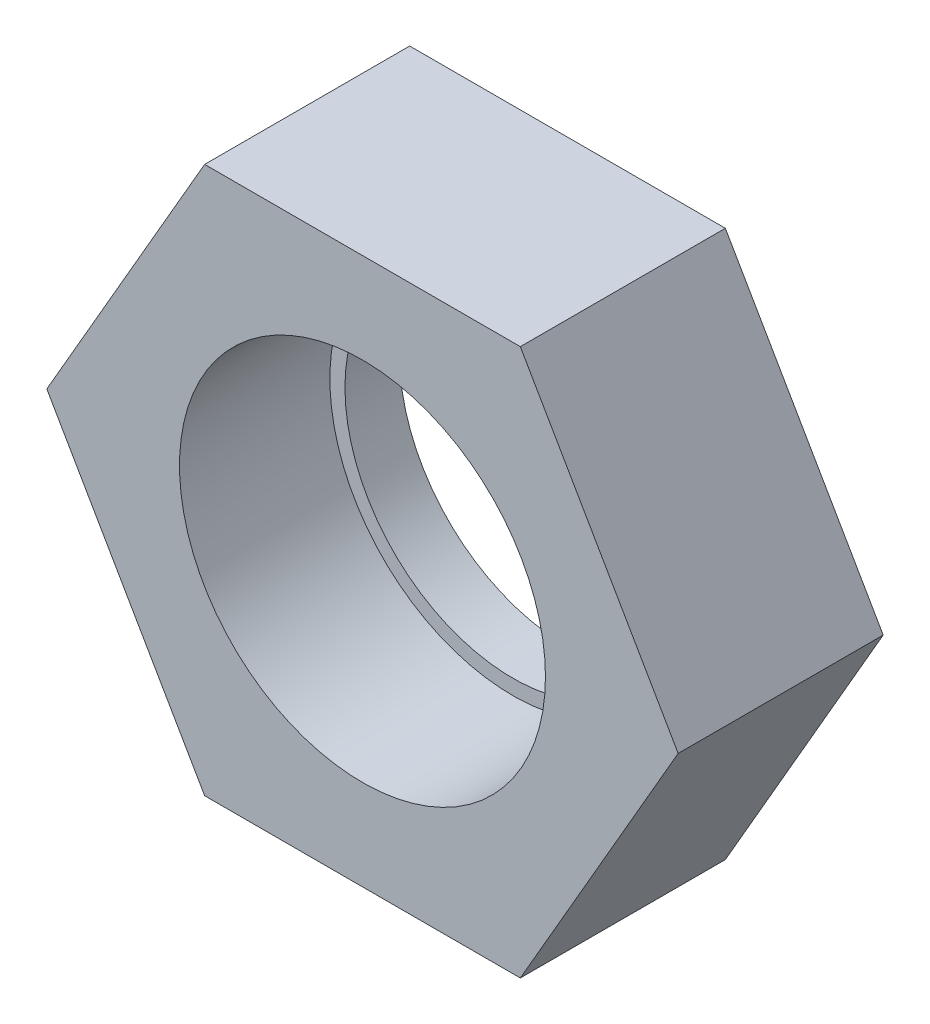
ISO-10303-21;
HEADER;
FILE_DESCRIPTION(('STEP AP214'),'2;1');
FILE_NAME('part.step','',(''),(''),'','','');
FILE_SCHEMA(('AUTOMOTIVE_DESIGN { 1 0 10303 214 1 1 1 1 }'));
ENDSEC;
DATA;
#1=APPLICATION_CONTEXT('core data for automotive mechanical design processes');
#2=APPLICATION_PROTOCOL_DEFINITION('international standard','automotive_design',2000,#1);
#3=PRODUCT_CONTEXT('',#1,'mechanical');
#4=PRODUCT('Part','Part','',(#3));
#5=PRODUCT_RELATED_PRODUCT_CATEGORY('part','',(#4));
#6=PRODUCT_DEFINITION_FORMATION('','',#4);
#7=PRODUCT_DEFINITION_CONTEXT('part definition',#1,'design');
#8=PRODUCT_DEFINITION('design','',#6,#7);
#9=PRODUCT_DEFINITION_SHAPE('','',#8);
#10=(LENGTH_UNIT() NAMED_UNIT(*) SI_UNIT(.MILLI.,.METRE.));
#11=(NAMED_UNIT(*) PLANE_ANGLE_UNIT() SI_UNIT($,.RADIAN.));
#12=(NAMED_UNIT(*) SI_UNIT($,.STERADIAN.) SOLID_ANGLE_UNIT());
#13=UNCERTAINTY_MEASURE_WITH_UNIT(LENGTH_MEASURE(1.E-05),#10,'distance_accuracy_value','');
#14=(GEOMETRIC_REPRESENTATION_CONTEXT(3) GLOBAL_UNCERTAINTY_ASSIGNED_CONTEXT((#13)) GLOBAL_UNIT_ASSIGNED_CONTEXT((#10,
#11,#12)) REPRESENTATION_CONTEXT('',''));
#15=CARTESIAN_POINT('',(0.,0.,0.));
#16=DIRECTION('',(0.,0.,1.));
#17=DIRECTION('',(1.,0.,0.));
#18=AXIS2_PLACEMENT_3D('',#15,#16,#17);
#19=CARTESIAN_POINT('',(8.9916,0.,2.54));
#20=DIRECTION('',(0.,0.,1.));
#21=DIRECTION('',(1.,0.,0.));
#22=AXIS2_PLACEMENT_3D('',#19,#20,#21);
#23=PLANE('',#22);
#24=CARTESIAN_POINT('',(0.,0.,2.54));
#25=DIRECTION('',(0.,0.,1.));
#26=DIRECTION('',(1.,0.,0.));
#27=AXIS2_PLACEMENT_3D('',#24,#25,#26);
#28=CIRCLE('',#27,8.5);
#29=CARTESIAN_POINT('',(8.5,0.,2.54));
#30=VERTEX_POINT('',#29);
#31=EDGE_CURVE('E86',#30,#30,#28,.F.);
#32=ORIENTED_EDGE('',*,*,#31,.F.);
#33=EDGE_LOOP('',(#32));
#34=FACE_BOUND('',#33,.T.);
#35=CARTESIAN_POINT('',(0.,0.,2.54));
#36=DIRECTION('',(0.,0.,1.));
#37=DIRECTION('',(1.,0.,0.));
#38=AXIS2_PLACEMENT_3D('',#35,#36,#37);
#39=CIRCLE('',#38,7.8);
#40=CARTESIAN_POINT('',(7.8,0.,2.54));
#41=VERTEX_POINT('',#40);
#42=EDGE_CURVE('E240',#41,#41,#39,.T.);
#43=ORIENTED_EDGE('',*,*,#42,.F.);
#44=EDGE_LOOP('',(#43));
#45=FACE_BOUND('',#44,.T.);
#46=ADVANCED_FACE('F14',(#34,#45),#23,.T.);
#47=CARTESIAN_POINT('',(21.9970452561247,12.7,9.525));
#48=DIRECTION('',(0.,0.,1.));
#49=DIRECTION('',(1.,0.,0.));
#50=AXIS2_PLACEMENT_3D('',#47,#48,#49);
#51=PLANE('',#50);
#52=DIRECTION('',(0.5,0.866025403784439,0.));
#53=VECTOR('',#52,1.);
#54=CARTESIAN_POINT('',(7.33234841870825,-12.7,9.525));
#55=LINE('',#54,#53);
#56=CARTESIAN_POINT('',(7.33234841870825,-12.7,9.525));
#57=VERTEX_POINT('',#56);
#58=CARTESIAN_POINT('',(14.6646968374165,0.,9.525));
#59=VERTEX_POINT('',#58);
#60=EDGE_CURVE('E100',#57,#59,#55,.T.);
#61=ORIENTED_EDGE('',*,*,#60,.T.);
#62=DIRECTION('',(-0.5,0.866025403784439,0.));
#63=VECTOR('',#62,1.);
#64=CARTESIAN_POINT('',(14.6646968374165,0.,9.525));
#65=LINE('',#64,#63);
#66=CARTESIAN_POINT('',(7.33234841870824,12.7,9.525));
#67=VERTEX_POINT('',#66);
#68=EDGE_CURVE('E81',#59,#67,#65,.T.);
#69=ORIENTED_EDGE('',*,*,#68,.T.);
#70=DIRECTION('',(-1.,0.,0.));
#71=VECTOR('',#70,1.);
#72=CARTESIAN_POINT('',(7.33234841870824,12.7,9.525));
#73=LINE('',#72,#71);
#74=CARTESIAN_POINT('',(-7.33234841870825,12.7,9.525));
#75=VERTEX_POINT('',#74);
#76=EDGE_CURVE('E103',#67,#75,#73,.T.);
#77=ORIENTED_EDGE('',*,*,#76,.T.);
#78=DIRECTION('',(-0.5,-0.866025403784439,0.));
#79=VECTOR('',#78,1.);
#80=CARTESIAN_POINT('',(-7.33234841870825,12.7,9.525));
#81=LINE('',#80,#79);
#82=CARTESIAN_POINT('',(-14.6646968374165,0.,9.525));
#83=VERTEX_POINT('',#82);
#84=EDGE_CURVE('E105',#75,#83,#81,.T.);
#85=ORIENTED_EDGE('',*,*,#84,.T.);
#86=DIRECTION('',(0.5,-0.866025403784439,0.));
#87=VECTOR('',#86,1.);
#88=CARTESIAN_POINT('',(-14.6646968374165,0.,9.525));
#89=LINE('',#88,#87);
#90=CARTESIAN_POINT('',(-7.33234841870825,-12.7,9.525));
#91=VERTEX_POINT('',#90);
#92=EDGE_CURVE('E34',#83,#91,#89,.T.);
#93=ORIENTED_EDGE('',*,*,#92,.T.);
#94=DIRECTION('',(1.,0.,0.));
#95=VECTOR('',#94,1.);
#96=CARTESIAN_POINT('',(-7.33234841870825,-12.7,9.525));
#97=LINE('',#96,#95);
#98=EDGE_CURVE('E29',#91,#57,#97,.T.);
#99=ORIENTED_EDGE('',*,*,#98,.T.);
#100=EDGE_LOOP('',(#61,#69,#77,#85,#93,#99));
#101=FACE_BOUND('',#100,.T.);
#102=CARTESIAN_POINT('',(0.,0.,9.525));
#103=DIRECTION('',(0.,0.,1.));
#104=DIRECTION('',(1.,0.,0.));
#105=AXIS2_PLACEMENT_3D('',#102,#103,#104);
#106=CIRCLE('',#105,8.5);
#107=CARTESIAN_POINT('',(8.5,0.,9.525));
#108=VERTEX_POINT('',#107);
#109=EDGE_CURVE('E89',#108,#108,#106,.T.);
#110=ORIENTED_EDGE('',*,*,#109,.F.);
#111=EDGE_LOOP('',(#110));
#112=FACE_BOUND('',#111,.T.);
#113=ADVANCED_FACE('F123',(#101,#112),#51,.T.);
#114=CARTESIAN_POINT('',(21.9970452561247,12.7,0.));
#115=DIRECTION('',(0.,0.,1.));
#116=DIRECTION('',(1.,0.,0.));
#117=AXIS2_PLACEMENT_3D('',#114,#115,#116);
#118=PLANE('',#117);
#119=DIRECTION('',(0.5,0.866025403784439,0.));
#120=VECTOR('',#119,1.);
#121=CARTESIAN_POINT('',(7.33234841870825,-12.7,0.));
#122=LINE('',#121,#120);
#123=CARTESIAN_POINT('',(7.33234841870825,-12.7,0.));
#124=VERTEX_POINT('',#123);
#125=CARTESIAN_POINT('',(14.6646968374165,0.,0.));
#126=VERTEX_POINT('',#125);
#127=EDGE_CURVE('E72',#124,#126,#122,.T.);
#128=ORIENTED_EDGE('',*,*,#127,.F.);
#129=DIRECTION('',(1.,0.,0.));
#130=VECTOR('',#129,1.);
#131=CARTESIAN_POINT('',(-7.33234841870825,-12.7,0.));
#132=LINE('',#131,#130);
#133=CARTESIAN_POINT('',(-7.33234841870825,-12.7,0.));
#134=VERTEX_POINT('',#133);
#135=EDGE_CURVE('E98',#134,#124,#132,.T.);
#136=ORIENTED_EDGE('',*,*,#135,.F.);
#137=DIRECTION('',(0.5,-0.866025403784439,0.));
#138=VECTOR('',#137,1.);
#139=CARTESIAN_POINT('',(-14.6646968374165,0.,0.));
#140=LINE('',#139,#138);
#141=CARTESIAN_POINT('',(-14.6646968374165,0.,0.));
#142=VERTEX_POINT('',#141);
#143=EDGE_CURVE('E96',#142,#134,#140,.T.);
#144=ORIENTED_EDGE('',*,*,#143,.F.);
#145=DIRECTION('',(-0.5,-0.866025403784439,0.));
#146=VECTOR('',#145,1.);
#147=CARTESIAN_POINT('',(-7.33234841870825,12.7,0.));
#148=LINE('',#147,#146);
#149=CARTESIAN_POINT('',(-7.33234841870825,12.7,0.));
#150=VERTEX_POINT('',#149);
#151=EDGE_CURVE('E94',#150,#142,#148,.T.);
#152=ORIENTED_EDGE('',*,*,#151,.F.);
#153=DIRECTION('',(-1.,0.,0.));
#154=VECTOR('',#153,1.);
#155=CARTESIAN_POINT('',(7.33234841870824,12.7,0.));
#156=LINE('',#155,#154);
#157=CARTESIAN_POINT('',(7.33234841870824,12.7,0.));
#158=VERTEX_POINT('',#157);
#159=EDGE_CURVE('E74',#158,#150,#156,.T.);
#160=ORIENTED_EDGE('',*,*,#159,.F.);
#161=DIRECTION('',(-0.5,0.866025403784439,0.));
#162=VECTOR('',#161,1.);
#163=CARTESIAN_POINT('',(14.6646968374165,0.,0.));
#164=LINE('',#163,#162);
#165=EDGE_CURVE('E67',#126,#158,#164,.T.);
#166=ORIENTED_EDGE('',*,*,#165,.F.);
#167=EDGE_LOOP('',(#128,#136,#144,#152,#160,#166));
#168=FACE_BOUND('',#167,.T.);
#169=CARTESIAN_POINT('',(0.,0.,0.));
#170=DIRECTION('',(0.,0.,1.));
#171=DIRECTION('',(1.,0.,0.));
#172=AXIS2_PLACEMENT_3D('',#169,#170,#171);
#173=CIRCLE('',#172,7.8);
#174=CARTESIAN_POINT('',(7.8,0.,0.));
#175=VERTEX_POINT('',#174);
#176=EDGE_CURVE('E237',#175,#175,#173,.F.);
#177=ORIENTED_EDGE('',*,*,#176,.F.);
#178=EDGE_LOOP('',(#177));
#179=FACE_BOUND('',#178,.T.);
#180=ADVANCED_FACE('F68',(#168,#179),#118,.F.);
#181=CARTESIAN_POINT('',(7.33234841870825,-12.7,9.525));
#182=DIRECTION('',(-0.866025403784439,0.5,0.));
#183=DIRECTION('',(-0.5,-0.866025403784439,0.));
#184=AXIS2_PLACEMENT_3D('',#181,#182,#183);
#185=PLANE('',#184);
#186=ORIENTED_EDGE('',*,*,#127,.T.);
#187=DIRECTION('',(0.,0.,-1.));
#188=VECTOR('',#187,1.);
#189=CARTESIAN_POINT('',(14.6646968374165,0.,9.525));
#190=LINE('',#189,#188);
#191=EDGE_CURVE('E9',#59,#126,#190,.T.);
#192=ORIENTED_EDGE('',*,*,#191,.F.);
#193=ORIENTED_EDGE('',*,*,#60,.F.);
#194=DIRECTION('',(0.,0.,-1.));
#195=VECTOR('',#194,1.);
#196=CARTESIAN_POINT('',(7.33234841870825,-12.7,9.525));
#197=LINE('',#196,#195);
#198=EDGE_CURVE('E85',#57,#124,#197,.T.);
#199=ORIENTED_EDGE('',*,*,#198,.T.);
#200=EDGE_LOOP('',(#186,#192,#193,#199));
#201=FACE_BOUND('',#200,.T.);
#202=ADVANCED_FACE('F16',(#201),#185,.F.);
#203=CARTESIAN_POINT('',(14.6646968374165,0.,9.525));
#204=DIRECTION('',(-0.866025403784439,-0.5,0.));
#205=DIRECTION('',(0.5,-0.866025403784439,0.));
#206=AXIS2_PLACEMENT_3D('',#203,#204,#205);
#207=PLANE('',#206);
#208=ORIENTED_EDGE('',*,*,#165,.T.);
#209=DIRECTION('',(0.,0.,-1.));
#210=VECTOR('',#209,1.);
#211=CARTESIAN_POINT('',(7.33234841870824,12.7,9.525));
#212=LINE('',#211,#210);
#213=EDGE_CURVE('E22',#67,#158,#212,.T.);
#214=ORIENTED_EDGE('',*,*,#213,.F.);
#215=ORIENTED_EDGE('',*,*,#68,.F.);
#216=ORIENTED_EDGE('',*,*,#191,.T.);
#217=EDGE_LOOP('',(#208,#214,#215,#216));
#218=FACE_BOUND('',#217,.T.);
#219=ADVANCED_FACE('F80',(#218),#207,.F.);
#220=CARTESIAN_POINT('',(7.33234841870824,12.7,9.525));
#221=DIRECTION('',(0.,-1.,0.));
#222=DIRECTION('',(0.,0.,-1.));
#223=AXIS2_PLACEMENT_3D('',#220,#221,#222);
#224=PLANE('',#223);
#225=ORIENTED_EDGE('',*,*,#159,.T.);
#226=DIRECTION('',(0.,0.,-1.));
#227=VECTOR('',#226,1.);
#228=CARTESIAN_POINT('',(-7.33234841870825,12.7,9.525));
#229=LINE('',#228,#227);
#230=EDGE_CURVE('E116',#75,#150,#229,.T.);
#231=ORIENTED_EDGE('',*,*,#230,.F.);
#232=ORIENTED_EDGE('',*,*,#76,.F.);
#233=ORIENTED_EDGE('',*,*,#213,.T.);
#234=EDGE_LOOP('',(#225,#231,#232,#233));
#235=FACE_BOUND('',#234,.T.);
#236=ADVANCED_FACE('F120',(#235),#224,.F.);
#237=CARTESIAN_POINT('',(-7.33234841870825,12.7,9.525));
#238=DIRECTION('',(0.866025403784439,-0.5,0.));
#239=DIRECTION('',(0.5,0.866025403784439,0.));
#240=AXIS2_PLACEMENT_3D('',#237,#238,#239);
#241=PLANE('',#240);
#242=ORIENTED_EDGE('',*,*,#151,.T.);
#243=DIRECTION('',(0.,0.,-1.));
#244=VECTOR('',#243,1.);
#245=CARTESIAN_POINT('',(-14.6646968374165,0.,9.525));
#246=LINE('',#245,#244);
#247=EDGE_CURVE('E113',#83,#142,#246,.T.);
#248=ORIENTED_EDGE('',*,*,#247,.F.);
#249=ORIENTED_EDGE('',*,*,#84,.F.);
#250=ORIENTED_EDGE('',*,*,#230,.T.);
#251=EDGE_LOOP('',(#242,#248,#249,#250));
#252=FACE_BOUND('',#251,.T.);
#253=ADVANCED_FACE('F127',(#252),#241,.F.);
#254=CARTESIAN_POINT('',(-14.6646968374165,0.,9.525));
#255=DIRECTION('',(0.866025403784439,0.5,0.));
#256=DIRECTION('',(-0.5,0.866025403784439,0.));
#257=AXIS2_PLACEMENT_3D('',#254,#255,#256);
#258=PLANE('',#257);
#259=ORIENTED_EDGE('',*,*,#143,.T.);
#260=DIRECTION('',(0.,0.,-1.));
#261=VECTOR('',#260,1.);
#262=CARTESIAN_POINT('',(-7.33234841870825,-12.7,9.525));
#263=LINE('',#262,#261);
#264=EDGE_CURVE('E110',#91,#134,#263,.T.);
#265=ORIENTED_EDGE('',*,*,#264,.F.);
#266=ORIENTED_EDGE('',*,*,#92,.F.);
#267=ORIENTED_EDGE('',*,*,#247,.T.);
#268=EDGE_LOOP('',(#259,#265,#266,#267));
#269=FACE_BOUND('',#268,.T.);
#270=ADVANCED_FACE('F130',(#269),#258,.F.);
#271=CARTESIAN_POINT('',(-7.33234841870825,-12.7,9.525));
#272=DIRECTION('',(0.,1.,0.));
#273=DIRECTION('',(0.,0.,1.));
#274=AXIS2_PLACEMENT_3D('',#271,#272,#273);
#275=PLANE('',#274);
#276=ORIENTED_EDGE('',*,*,#135,.T.);
#277=ORIENTED_EDGE('',*,*,#198,.F.);
#278=ORIENTED_EDGE('',*,*,#98,.F.);
#279=ORIENTED_EDGE('',*,*,#264,.T.);
#280=EDGE_LOOP('',(#276,#277,#278,#279));
#281=FACE_BOUND('',#280,.T.);
#282=ADVANCED_FACE('F132',(#281),#275,.F.);
#283=CARTESIAN_POINT('',(0.,0.,-24.555330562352));
#284=DIRECTION('',(0.,0.,1.));
#285=DIRECTION('',(1.,0.,0.));
#286=AXIS2_PLACEMENT_3D('',#283,#284,#285);
#287=CYLINDRICAL_SURFACE('',#286,8.5);
#288=ORIENTED_EDGE('',*,*,#31,.T.);
#289=EDGE_LOOP('',(#288));
#290=FACE_BOUND('',#289,.T.);
#291=ORIENTED_EDGE('',*,*,#109,.T.);
#292=EDGE_LOOP('',(#291));
#293=FACE_BOUND('',#292,.T.);
#294=ADVANCED_FACE('F134',(#290,#293),#287,.F.);
#295=CARTESIAN_POINT('',(0.,0.,-24.0416305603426));
#296=DIRECTION('',(0.,0.,1.));
#297=DIRECTION('',(1.,0.,0.));
#298=AXIS2_PLACEMENT_3D('',#295,#296,#297);
#299=CYLINDRICAL_SURFACE('',#298,7.8);
#300=ORIENTED_EDGE('',*,*,#176,.T.);
#301=EDGE_LOOP('',(#300));
#302=FACE_BOUND('',#301,.T.);
#303=ORIENTED_EDGE('',*,*,#42,.T.);
#304=EDGE_LOOP('',(#303));
#305=FACE_BOUND('',#304,.T.);
#306=ADVANCED_FACE('F142',(#302,#305),#299,.F.);
#307=CLOSED_SHELL('',(#46,#113,#180,#202,#219,#236,#253,#270,#282,#294,#306));
#308=MANIFOLD_SOLID_BREP('B1',#307);
#309=ADVANCED_BREP_SHAPE_REPRESENTATION('',(#18,#308),#14);
#310=SHAPE_DEFINITION_REPRESENTATION(#9,#309);
ENDSEC;
END-ISO-10303-21;
